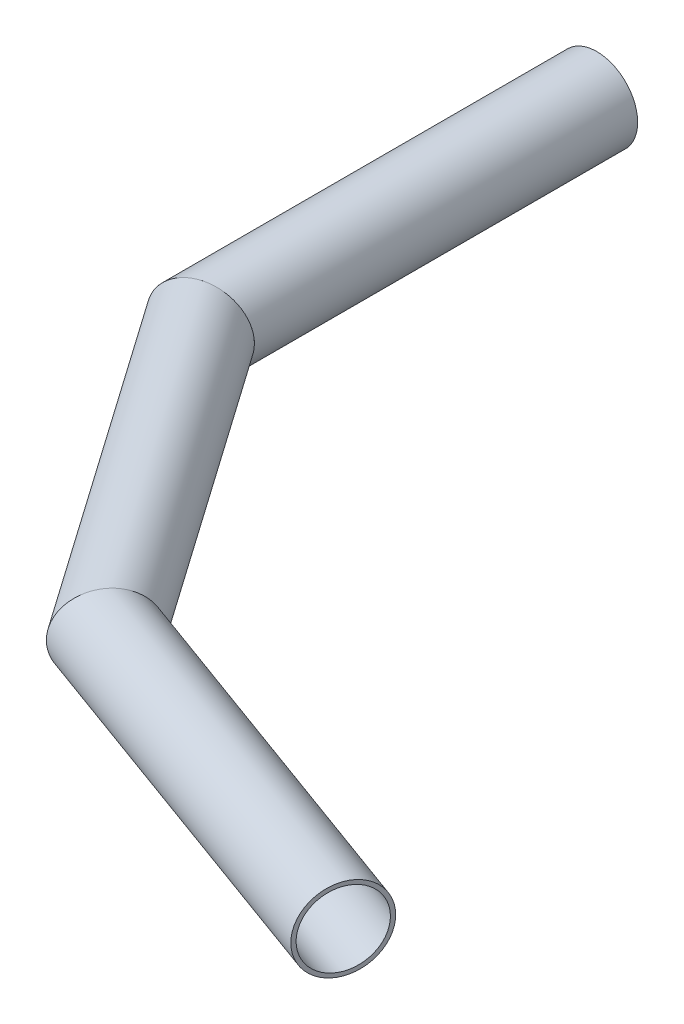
ISO-10303-21;
HEADER;
FILE_DESCRIPTION(('STEP AP214'),'2;1');
FILE_NAME('part.step','',(''),(''),'','','');
FILE_SCHEMA(('AUTOMOTIVE_DESIGN { 1 0 10303 214 1 1 1 1 }'));
ENDSEC;
DATA;
#1=APPLICATION_CONTEXT('core data for automotive mechanical design processes');
#2=APPLICATION_PROTOCOL_DEFINITION('international standard','automotive_design',2000,#1);
#3=PRODUCT_CONTEXT('',#1,'mechanical');
#4=PRODUCT('Part','Part','',(#3));
#5=PRODUCT_RELATED_PRODUCT_CATEGORY('part','',(#4));
#6=PRODUCT_DEFINITION_FORMATION('','',#4);
#7=PRODUCT_DEFINITION_CONTEXT('part definition',#1,'design');
#8=PRODUCT_DEFINITION('design','',#6,#7);
#9=PRODUCT_DEFINITION_SHAPE('','',#8);
#10=(LENGTH_UNIT() NAMED_UNIT(*) SI_UNIT(.MILLI.,.METRE.));
#11=(NAMED_UNIT(*) PLANE_ANGLE_UNIT() SI_UNIT($,.RADIAN.));
#12=(NAMED_UNIT(*) SI_UNIT($,.STERADIAN.) SOLID_ANGLE_UNIT());
#13=UNCERTAINTY_MEASURE_WITH_UNIT(LENGTH_MEASURE(1.E-05),#10,'distance_accuracy_value','');
#14=(GEOMETRIC_REPRESENTATION_CONTEXT(3) GLOBAL_UNCERTAINTY_ASSIGNED_CONTEXT((#13)) GLOBAL_UNIT_ASSIGNED_CONTEXT((#10,
#11,#12)) REPRESENTATION_CONTEXT('',''));
#15=CARTESIAN_POINT('',(0.,0.,0.));
#16=DIRECTION('',(0.,0.,1.));
#17=DIRECTION('',(1.,0.,0.));
#18=AXIS2_PLACEMENT_3D('',#15,#16,#17);
#19=CARTESIAN_POINT('',(144.747107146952,0.,206.720292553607));
#20=DIRECTION('',(-0.93969262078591,0.,-0.342020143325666));
#21=DIRECTION('',(-0.342020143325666,0.,0.93969262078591));
#22=AXIS2_PLACEMENT_3D('',#19,#20,#21);
#23=CYLINDRICAL_SURFACE('',#22,9.99999999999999);
#24=CARTESIAN_POINT('',(144.747107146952,0.,206.720292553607));
#25=DIRECTION('',(0.939692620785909,0.,0.342020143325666));
#26=DIRECTION('',(0.342020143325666,0.,-0.939692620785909));
#27=AXIS2_PLACEMENT_3D('',#24,#25,#26);
#28=CIRCLE('',#27,9.99999999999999);
#29=CARTESIAN_POINT('',(148.167308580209,0.,197.323366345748));
#30=VERTEX_POINT('',#29);
#31=EDGE_CURVE('E12',#30,#30,#28,.T.);
#32=ORIENTED_EDGE('',*,*,#31,.F.);
#33=EDGE_LOOP('',(#32));
#34=FACE_BOUND('',#33,.T.);
#35=CARTESIAN_POINT('',(53.7406845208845,0.,173.596663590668));
#36=DIRECTION('',(-0.793353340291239,0.,-0.608761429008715));
#37=DIRECTION('',(-0.608761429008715,0.,0.793353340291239));
#38=AXIS2_PLACEMENT_3D('',#35,#36,#37);
#39=ELLIPSE('',#38,10.4852912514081,9.99999999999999);
#40=CARTESIAN_POINT('',(47.3576436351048,0.,181.915204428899));
#41=VERTEX_POINT('',#40);
#42=EDGE_CURVE('E67',#41,#41,#39,.T.);
#43=ORIENTED_EDGE('',*,*,#42,.F.);
#44=EDGE_LOOP('',(#43));
#45=FACE_BOUND('',#44,.T.);
#46=ADVANCED_FACE('F56',(#34,#45),#23,.T.);
#47=CARTESIAN_POINT('',(144.747107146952,0.,206.720292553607));
#48=DIRECTION('',(-0.93969262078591,0.,-0.342020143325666));
#49=DIRECTION('',(-0.342020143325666,0.,0.93969262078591));
#50=AXIS2_PLACEMENT_3D('',#47,#48,#49);
#51=CYLINDRICAL_SURFACE('',#50,8.99999999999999);
#52=CARTESIAN_POINT('',(144.747107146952,0.,206.720292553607));
#53=DIRECTION('',(0.939692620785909,0.,0.342020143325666));
#54=DIRECTION('',(0.342020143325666,0.,-0.939692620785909));
#55=AXIS2_PLACEMENT_3D('',#52,#53,#54);
#56=CIRCLE('',#55,8.99999999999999);
#57=CARTESIAN_POINT('',(147.825288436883,0.,198.263058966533));
#58=VERTEX_POINT('',#57);
#59=EDGE_CURVE('E63',#58,#58,#56,.T.);
#60=ORIENTED_EDGE('',*,*,#59,.T.);
#61=EDGE_LOOP('',(#60));
#62=FACE_BOUND('',#61,.T.);
#63=CARTESIAN_POINT('',(53.7406845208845,0.,173.596663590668));
#64=DIRECTION('',(-0.793353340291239,0.,-0.608761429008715));
#65=DIRECTION('',(-0.608761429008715,0.,0.793353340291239));
#66=AXIS2_PLACEMENT_3D('',#63,#64,#65);
#67=ELLIPSE('',#66,9.43676212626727,8.99999999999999);
#68=CARTESIAN_POINT('',(47.9959477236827,0.,181.083350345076));
#69=VERTEX_POINT('',#68);
#70=EDGE_CURVE('E59',#69,#69,#67,.T.);
#71=ORIENTED_EDGE('',*,*,#70,.T.);
#72=EDGE_LOOP('',(#71));
#73=FACE_BOUND('',#72,.T.);
#74=ADVANCED_FACE('F76',(#62,#73),#51,.F.);
#75=CARTESIAN_POINT('',(144.747107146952,0.,206.720292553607));
#76=DIRECTION('',(0.939692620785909,0.,0.342020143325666));
#77=DIRECTION('',(0.342020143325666,0.,-0.939692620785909));
#78=AXIS2_PLACEMENT_3D('',#75,#76,#77);
#79=PLANE('',#78);
#80=ORIENTED_EDGE('',*,*,#31,.T.);
#81=EDGE_LOOP('',(#80));
#82=FACE_BOUND('',#81,.T.);
#83=ORIENTED_EDGE('',*,*,#59,.F.);
#84=EDGE_LOOP('',(#83));
#85=FACE_BOUND('',#84,.T.);
#86=ADVANCED_FACE('F80',(#82,#85),#79,.T.);
#87=CARTESIAN_POINT('',(60.1237254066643,100.,165.278122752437));
#88=DIRECTION('',(-0.793353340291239,0.,-0.608761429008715));
#89=DIRECTION('',(-0.608761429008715,0.,0.793353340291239));
#90=AXIS2_PLACEMENT_3D('',#87,#88,#89);
#91=PLANE('',#90);
#92=ORIENTED_EDGE('',*,*,#70,.F.);
#93=EDGE_LOOP('',(#92));
#94=FACE_BOUND('',#93,.T.);
#95=ORIENTED_EDGE('',*,*,#42,.T.);
#96=EDGE_LOOP('',(#95));
#97=FACE_BOUND('',#96,.T.);
#98=ADVANCED_FACE('F78',(#94,#97),#91,.T.);
#99=CLOSED_SHELL('',(#46,#74,#86,#98));
#100=MANIFOLD_SOLID_BREP('B2',#99);
#101=CARTESIAN_POINT('',(55.5491640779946,0.,176.179440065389));
#102=DIRECTION('',(-0.573576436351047,0.,-0.819152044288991));
#103=DIRECTION('',(-0.819152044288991,0.,0.573576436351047));
#104=AXIS2_PLACEMENT_3D('',#101,#102,#103);
#105=CYLINDRICAL_SURFACE('',#104,10.);
#106=CARTESIAN_POINT('',(0.,0.,96.8470121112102));
#107=DIRECTION('',(0.300705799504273,0.,0.953716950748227));
#108=DIRECTION('',(-0.953716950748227,0.,0.300705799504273));
#109=AXIS2_PLACEMENT_3D('',#106,#107,#108);
#110=ELLIPSE('',#109,10.4852912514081,10.);
#111=CARTESIAN_POINT('',(-10.,0.,100.));
#112=VERTEX_POINT('',#111);
#113=EDGE_CURVE('E55',#112,#112,#110,.T.);
#114=ORIENTED_EDGE('',*,*,#113,.T.);
#115=EDGE_LOOP('',(#114));
#116=FACE_BOUND('',#115,.T.);
#117=CARTESIAN_POINT('',(53.7406845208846,0.,173.596663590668));
#118=DIRECTION('',(0.793353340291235,0.,0.608761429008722));
#119=DIRECTION('',(0.608761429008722,0.,-0.793353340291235));
#120=AXIS2_PLACEMENT_3D('',#117,#118,#119);
#121=ELLIPSE('',#120,10.4852912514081,10.);
#122=CARTESIAN_POINT('',(60.1237254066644,0.,165.278122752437));
#123=VERTEX_POINT('',#122);
#124=EDGE_CURVE('E137',#123,#123,#121,.T.);
#125=ORIENTED_EDGE('',*,*,#124,.F.);
#126=EDGE_LOOP('',(#125));
#127=FACE_BOUND('',#126,.T.);
#128=ADVANCED_FACE('F125',(#116,#127),#105,.T.);
#129=CARTESIAN_POINT('',(55.5491640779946,0.,176.179440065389));
#130=DIRECTION('',(-0.573576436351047,0.,-0.819152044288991));
#131=DIRECTION('',(-0.819152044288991,0.,0.573576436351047));
#132=AXIS2_PLACEMENT_3D('',#129,#130,#131);
#133=CYLINDRICAL_SURFACE('',#132,9.);
#134=CARTESIAN_POINT('',(0.,0.,96.8470121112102));
#135=DIRECTION('',(0.300705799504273,0.,0.953716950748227));
#136=DIRECTION('',(-0.953716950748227,0.,0.300705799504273));
#137=AXIS2_PLACEMENT_3D('',#134,#135,#136);
#138=ELLIPSE('',#137,9.4367621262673,9.);
#139=CARTESIAN_POINT('',(-9.,0.,99.684701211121));
#140=VERTEX_POINT('',#139);
#141=EDGE_CURVE('E132',#140,#140,#138,.T.);
#142=ORIENTED_EDGE('',*,*,#141,.F.);
#143=EDGE_LOOP('',(#142));
#144=FACE_BOUND('',#143,.T.);
#145=CARTESIAN_POINT('',(53.7406845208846,0.,173.596663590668));
#146=DIRECTION('',(0.793353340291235,0.,0.608761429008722));
#147=DIRECTION('',(0.608761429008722,0.,-0.793353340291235));
#148=AXIS2_PLACEMENT_3D('',#145,#146,#147);
#149=ELLIPSE('',#148,9.43676212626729,9.);
#150=CARTESIAN_POINT('',(59.4854213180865,0.,166.10997683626));
#151=VERTEX_POINT('',#150);
#152=EDGE_CURVE('E128',#151,#151,#149,.T.);
#153=ORIENTED_EDGE('',*,*,#152,.T.);
#154=EDGE_LOOP('',(#153));
#155=FACE_BOUND('',#154,.T.);
#156=ADVANCED_FACE('F145',(#144,#155),#133,.F.);
#157=CARTESIAN_POINT('',(-10.,-10.,100.));
#158=DIRECTION('',(0.300705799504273,0.,0.953716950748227));
#159=DIRECTION('',(0.953716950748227,0.,-0.300705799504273));
#160=AXIS2_PLACEMENT_3D('',#157,#158,#159);
#161=PLANE('',#160);
#162=ORIENTED_EDGE('',*,*,#141,.T.);
#163=EDGE_LOOP('',(#162));
#164=FACE_BOUND('',#163,.T.);
#165=ORIENTED_EDGE('',*,*,#113,.F.);
#166=EDGE_LOOP('',(#165));
#167=FACE_BOUND('',#166,.T.);
#168=ADVANCED_FACE('F149',(#164,#167),#161,.F.);
#169=CARTESIAN_POINT('',(47.3576436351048,100.,181.915204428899));
#170=DIRECTION('',(0.793353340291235,0.,0.608761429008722));
#171=DIRECTION('',(0.608761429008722,0.,-0.793353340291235));
#172=AXIS2_PLACEMENT_3D('',#169,#170,#171);
#173=PLANE('',#172);
#174=ORIENTED_EDGE('',*,*,#152,.F.);
#175=EDGE_LOOP('',(#174));
#176=FACE_BOUND('',#175,.T.);
#177=ORIENTED_EDGE('',*,*,#124,.T.);
#178=EDGE_LOOP('',(#177));
#179=FACE_BOUND('',#178,.T.);
#180=ADVANCED_FACE('F147',(#176,#179),#173,.T.);
#181=CLOSED_SHELL('',(#128,#156,#168,#180));
#182=MANIFOLD_SOLID_BREP('B7',#181);
#183=CARTESIAN_POINT('',(0.,0.,100.));
#184=DIRECTION('',(0.,0.,-1.));
#185=DIRECTION('',(-1.,0.,0.));
#186=AXIS2_PLACEMENT_3D('',#183,#184,#185);
#187=CYLINDRICAL_SURFACE('',#186,10.);
#188=CARTESIAN_POINT('',(0.,0.,0.));
#189=DIRECTION('',(0.,0.,1.));
#190=DIRECTION('',(1.,0.,0.));
#191=AXIS2_PLACEMENT_3D('',#188,#189,#190);
#192=CIRCLE('',#191,10.);
#193=CARTESIAN_POINT('',(10.,0.,0.));
#194=VERTEX_POINT('',#193);
#195=EDGE_CURVE('E124',#194,#194,#192,.T.);
#196=ORIENTED_EDGE('',*,*,#195,.T.);
#197=EDGE_LOOP('',(#196));
#198=FACE_BOUND('',#197,.T.);
#199=CARTESIAN_POINT('',(0.,0.,96.8470121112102));
#200=DIRECTION('',(-0.300705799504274,0.,-0.953716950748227));
#201=DIRECTION('',(0.953716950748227,0.,-0.300705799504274));
#202=AXIS2_PLACEMENT_3D('',#199,#200,#201);
#203=ELLIPSE('',#202,10.4852912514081,10.);
#204=CARTESIAN_POINT('',(10.,0.,93.6940242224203));
#205=VERTEX_POINT('',#204);
#206=EDGE_CURVE('E198',#205,#205,#203,.T.);
#207=ORIENTED_EDGE('',*,*,#206,.T.);
#208=EDGE_LOOP('',(#207));
#209=FACE_BOUND('',#208,.T.);
#210=ADVANCED_FACE('F187',(#198,#209),#187,.T.);
#211=CARTESIAN_POINT('',(0.,0.,0.));
#212=DIRECTION('',(0.,0.,1.));
#213=DIRECTION('',(1.,0.,0.));
#214=AXIS2_PLACEMENT_3D('',#211,#212,#213);
#215=PLANE('',#214);
#216=ORIENTED_EDGE('',*,*,#195,.F.);
#217=EDGE_LOOP('',(#216));
#218=FACE_BOUND('',#217,.T.);
#219=CARTESIAN_POINT('',(0.,0.,0.));
#220=DIRECTION('',(0.,0.,1.));
#221=DIRECTION('',(1.,0.,0.));
#222=AXIS2_PLACEMENT_3D('',#219,#220,#221);
#223=CIRCLE('',#222,9.);
#224=CARTESIAN_POINT('',(9.,0.,0.));
#225=VERTEX_POINT('',#224);
#226=EDGE_CURVE('E194',#225,#225,#223,.T.);
#227=ORIENTED_EDGE('',*,*,#226,.T.);
#228=EDGE_LOOP('',(#227));
#229=FACE_BOUND('',#228,.T.);
#230=ADVANCED_FACE('F213',(#218,#229),#215,.F.);
#231=CARTESIAN_POINT('',(0.,0.,100.));
#232=DIRECTION('',(0.,0.,-1.));
#233=DIRECTION('',(-1.,0.,0.));
#234=AXIS2_PLACEMENT_3D('',#231,#232,#233);
#235=CYLINDRICAL_SURFACE('',#234,9.);
#236=CARTESIAN_POINT('',(0.,0.,96.8470121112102));
#237=DIRECTION('',(-0.300705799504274,0.,-0.953716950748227));
#238=DIRECTION('',(0.953716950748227,0.,-0.300705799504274));
#239=AXIS2_PLACEMENT_3D('',#236,#237,#238);
#240=ELLIPSE('',#239,9.4367621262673,9.);
#241=CARTESIAN_POINT('',(9.,0.,94.0093230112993));
#242=VERTEX_POINT('',#241);
#243=EDGE_CURVE('E190',#242,#242,#240,.T.);
#244=ORIENTED_EDGE('',*,*,#243,.F.);
#245=EDGE_LOOP('',(#244));
#246=FACE_BOUND('',#245,.T.);
#247=ORIENTED_EDGE('',*,*,#226,.F.);
#248=EDGE_LOOP('',(#247));
#249=FACE_BOUND('',#248,.T.);
#250=ADVANCED_FACE('F210',(#246,#249),#235,.F.);
#251=CARTESIAN_POINT('',(-10.,-10.,100.));
#252=DIRECTION('',(-0.300705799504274,0.,-0.953716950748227));
#253=DIRECTION('',(-0.953716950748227,0.,0.300705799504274));
#254=AXIS2_PLACEMENT_3D('',#251,#252,#253);
#255=PLANE('',#254);
#256=ORIENTED_EDGE('',*,*,#243,.T.);
#257=EDGE_LOOP('',(#256));
#258=FACE_BOUND('',#257,.T.);
#259=ORIENTED_EDGE('',*,*,#206,.F.);
#260=EDGE_LOOP('',(#259));
#261=FACE_BOUND('',#260,.T.);
#262=ADVANCED_FACE('F207',(#258,#261),#255,.F.);
#263=CLOSED_SHELL('',(#210,#230,#250,#262));
#264=MANIFOLD_SOLID_BREP('B50',#263);
#265=ADVANCED_BREP_SHAPE_REPRESENTATION('',(#18,#100,#182,#264),#14);
#266=SHAPE_DEFINITION_REPRESENTATION(#9,#265);
ENDSEC;
END-ISO-10303-21;
